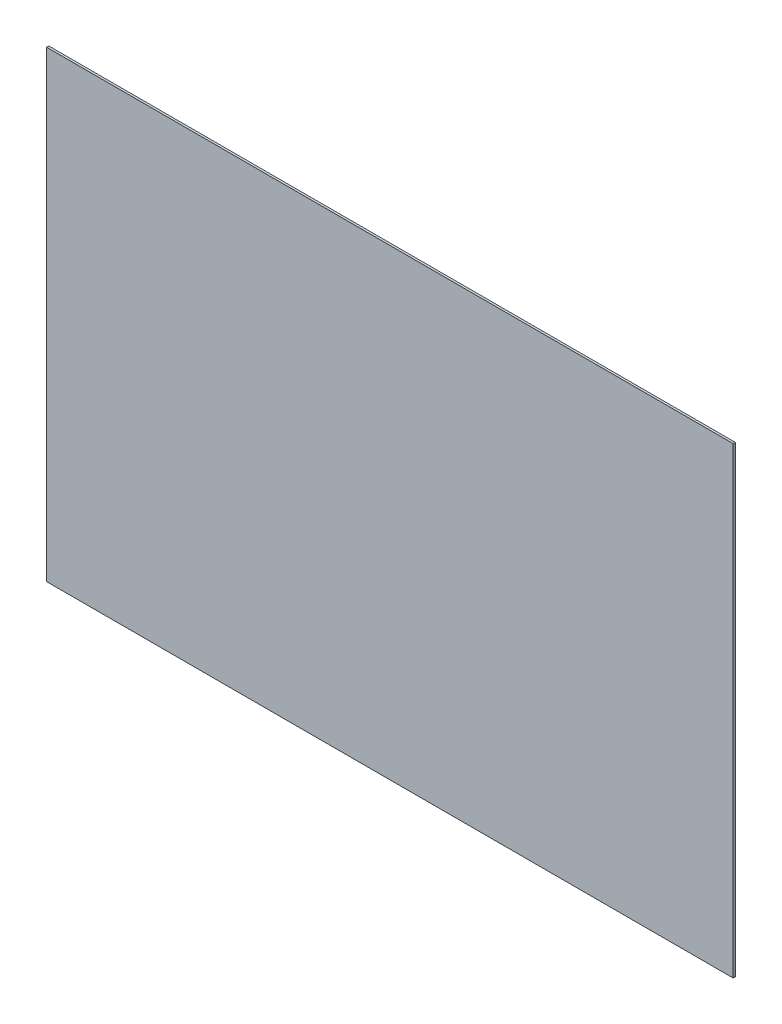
ISO-10303-21;
HEADER;
FILE_DESCRIPTION(('STEP AP214'),'2;1');
FILE_NAME('part.step','',(''),(''),'','','');
FILE_SCHEMA(('AUTOMOTIVE_DESIGN { 1 0 10303 214 1 1 1 1 }'));
ENDSEC;
DATA;
#1=APPLICATION_CONTEXT('core data for automotive mechanical design processes');
#2=APPLICATION_PROTOCOL_DEFINITION('international standard','automotive_design',2000,#1);
#3=PRODUCT_CONTEXT('',#1,'mechanical');
#4=PRODUCT('Part','Part','',(#3));
#5=PRODUCT_RELATED_PRODUCT_CATEGORY('part','',(#4));
#6=PRODUCT_DEFINITION_FORMATION('','',#4);
#7=PRODUCT_DEFINITION_CONTEXT('part definition',#1,'design');
#8=PRODUCT_DEFINITION('design','',#6,#7);
#9=PRODUCT_DEFINITION_SHAPE('','',#8);
#10=(LENGTH_UNIT() NAMED_UNIT(*) SI_UNIT(.MILLI.,.METRE.));
#11=(NAMED_UNIT(*) PLANE_ANGLE_UNIT() SI_UNIT($,.RADIAN.));
#12=(NAMED_UNIT(*) SI_UNIT($,.STERADIAN.) SOLID_ANGLE_UNIT());
#13=UNCERTAINTY_MEASURE_WITH_UNIT(LENGTH_MEASURE(1.E-05),#10,'distance_accuracy_value','');
#14=(GEOMETRIC_REPRESENTATION_CONTEXT(3) GLOBAL_UNCERTAINTY_ASSIGNED_CONTEXT((#13)) GLOBAL_UNIT_ASSIGNED_CONTEXT((#10,
#11,#12)) REPRESENTATION_CONTEXT('',''));
#15=CARTESIAN_POINT('',(0.,0.,0.));
#16=DIRECTION('',(0.,0.,1.));
#17=DIRECTION('',(1.,0.,0.));
#18=AXIS2_PLACEMENT_3D('',#15,#16,#17);
#19=CARTESIAN_POINT('',(0.,0.,3.));
#20=DIRECTION('',(1.,0.,0.));
#21=DIRECTION('',(0.,0.,-1.));
#22=AXIS2_PLACEMENT_3D('',#19,#20,#21);
#23=PLANE('',#22);
#24=DIRECTION('',(0.,-1.,0.));
#25=VECTOR('',#24,1.);
#26=CARTESIAN_POINT('',(0.,0.,0.));
#27=LINE('',#26,#25);
#28=CARTESIAN_POINT('',(0.,638.5,0.));
#29=VERTEX_POINT('',#28);
#30=CARTESIAN_POINT('',(0.,0.,0.));
#31=VERTEX_POINT('',#30);
#32=EDGE_CURVE('E95',#29,#31,#27,.T.);
#33=ORIENTED_EDGE('',*,*,#32,.T.);
#34=DIRECTION('',(0.,0.,-1.));
#35=VECTOR('',#34,1.);
#36=CARTESIAN_POINT('',(0.,0.,3.));
#37=LINE('',#36,#35);
#38=CARTESIAN_POINT('',(0.,0.,3.));
#39=VERTEX_POINT('',#38);
#40=EDGE_CURVE('E11',#39,#31,#37,.T.);
#41=ORIENTED_EDGE('',*,*,#40,.F.);
#42=DIRECTION('',(0.,-1.,0.));
#43=VECTOR('',#42,1.);
#44=CARTESIAN_POINT('',(0.,0.,3.));
#45=LINE('',#44,#43);
#46=CARTESIAN_POINT('',(0.,638.5,3.));
#47=VERTEX_POINT('',#46);
#48=EDGE_CURVE('E83',#47,#39,#45,.T.);
#49=ORIENTED_EDGE('',*,*,#48,.F.);
#50=DIRECTION('',(0.,0.,-1.));
#51=VECTOR('',#50,1.);
#52=CARTESIAN_POINT('',(0.,638.5,3.));
#53=LINE('',#52,#51);
#54=EDGE_CURVE('E91',#47,#29,#53,.T.);
#55=ORIENTED_EDGE('',*,*,#54,.T.);
#56=EDGE_LOOP('',(#33,#41,#49,#55));
#57=FACE_BOUND('',#56,.T.);
#58=ADVANCED_FACE('F32',(#57),#23,.F.);
#59=CARTESIAN_POINT('',(0.,0.,3.));
#60=DIRECTION('',(0.,1.,0.));
#61=DIRECTION('',(0.,0.,1.));
#62=AXIS2_PLACEMENT_3D('',#59,#60,#61);
#63=PLANE('',#62);
#64=DIRECTION('',(1.,0.,0.));
#65=VECTOR('',#64,1.);
#66=CARTESIAN_POINT('',(0.,0.,0.));
#67=LINE('',#66,#65);
#68=CARTESIAN_POINT('',(947.,0.,0.));
#69=VERTEX_POINT('',#68);
#70=EDGE_CURVE('E87',#31,#69,#67,.T.);
#71=ORIENTED_EDGE('',*,*,#70,.T.);
#72=DIRECTION('',(0.,0.,-1.));
#73=VECTOR('',#72,1.);
#74=CARTESIAN_POINT('',(947.,0.,3.));
#75=LINE('',#74,#73);
#76=CARTESIAN_POINT('',(947.,0.,3.));
#77=VERTEX_POINT('',#76);
#78=EDGE_CURVE('E40',#77,#69,#75,.T.);
#79=ORIENTED_EDGE('',*,*,#78,.F.);
#80=DIRECTION('',(1.,0.,0.));
#81=VECTOR('',#80,1.);
#82=CARTESIAN_POINT('',(0.,0.,3.));
#83=LINE('',#82,#81);
#84=EDGE_CURVE('E78',#39,#77,#83,.T.);
#85=ORIENTED_EDGE('',*,*,#84,.F.);
#86=ORIENTED_EDGE('',*,*,#40,.T.);
#87=EDGE_LOOP('',(#71,#79,#85,#86));
#88=FACE_BOUND('',#87,.T.);
#89=ADVANCED_FACE('F86',(#88),#63,.F.);
#90=CARTESIAN_POINT('',(947.,0.,3.));
#91=DIRECTION('',(-1.,0.,0.));
#92=DIRECTION('',(0.,0.,1.));
#93=AXIS2_PLACEMENT_3D('',#90,#91,#92);
#94=PLANE('',#93);
#95=DIRECTION('',(0.,1.,0.));
#96=VECTOR('',#95,1.);
#97=CARTESIAN_POINT('',(947.,0.,0.));
#98=LINE('',#97,#96);
#99=CARTESIAN_POINT('',(947.,638.5,0.));
#100=VERTEX_POINT('',#99);
#101=EDGE_CURVE('E65',#69,#100,#98,.T.);
#102=ORIENTED_EDGE('',*,*,#101,.T.);
#103=DIRECTION('',(0.,0.,-1.));
#104=VECTOR('',#103,1.);
#105=CARTESIAN_POINT('',(947.,638.5,3.));
#106=LINE('',#105,#104);
#107=CARTESIAN_POINT('',(947.,638.5,3.));
#108=VERTEX_POINT('',#107);
#109=EDGE_CURVE('E88',#108,#100,#106,.T.);
#110=ORIENTED_EDGE('',*,*,#109,.F.);
#111=DIRECTION('',(0.,1.,0.));
#112=VECTOR('',#111,1.);
#113=CARTESIAN_POINT('',(947.,0.,3.));
#114=LINE('',#113,#112);
#115=EDGE_CURVE('E81',#77,#108,#114,.T.);
#116=ORIENTED_EDGE('',*,*,#115,.F.);
#117=ORIENTED_EDGE('',*,*,#78,.T.);
#118=EDGE_LOOP('',(#102,#110,#116,#117));
#119=FACE_BOUND('',#118,.T.);
#120=ADVANCED_FACE('F89',(#119),#94,.F.);
#121=CARTESIAN_POINT('',(0.,638.5,3.));
#122=DIRECTION('',(0.,-1.,0.));
#123=DIRECTION('',(0.,0.,-1.));
#124=AXIS2_PLACEMENT_3D('',#121,#122,#123);
#125=PLANE('',#124);
#126=DIRECTION('',(-1.,0.,0.));
#127=VECTOR('',#126,1.);
#128=CARTESIAN_POINT('',(0.,638.5,0.));
#129=LINE('',#128,#127);
#130=EDGE_CURVE('E71',#100,#29,#129,.T.);
#131=ORIENTED_EDGE('',*,*,#130,.T.);
#132=ORIENTED_EDGE('',*,*,#54,.F.);
#133=DIRECTION('',(-1.,0.,0.));
#134=VECTOR('',#133,1.);
#135=CARTESIAN_POINT('',(0.,638.5,3.));
#136=LINE('',#135,#134);
#137=EDGE_CURVE('E48',#108,#47,#136,.T.);
#138=ORIENTED_EDGE('',*,*,#137,.F.);
#139=ORIENTED_EDGE('',*,*,#109,.T.);
#140=EDGE_LOOP('',(#131,#132,#138,#139));
#141=FACE_BOUND('',#140,.T.);
#142=ADVANCED_FACE('F102',(#141),#125,.F.);
#143=CARTESIAN_POINT('',(0.,638.5,3.));
#144=DIRECTION('',(0.,0.,-1.));
#145=DIRECTION('',(-1.,0.,0.));
#146=AXIS2_PLACEMENT_3D('',#143,#144,#145);
#147=PLANE('',#146);
#148=ORIENTED_EDGE('',*,*,#48,.T.);
#149=ORIENTED_EDGE('',*,*,#84,.T.);
#150=ORIENTED_EDGE('',*,*,#115,.T.);
#151=ORIENTED_EDGE('',*,*,#137,.T.);
#152=EDGE_LOOP('',(#148,#149,#150,#151));
#153=FACE_BOUND('',#152,.T.);
#154=ADVANCED_FACE('F79',(#153),#147,.F.);
#155=CARTESIAN_POINT('',(0.,638.5,0.));
#156=DIRECTION('',(0.,0.,-1.));
#157=DIRECTION('',(-1.,0.,0.));
#158=AXIS2_PLACEMENT_3D('',#155,#156,#157);
#159=PLANE('',#158);
#160=ORIENTED_EDGE('',*,*,#32,.F.);
#161=ORIENTED_EDGE('',*,*,#130,.F.);
#162=ORIENTED_EDGE('',*,*,#101,.F.);
#163=ORIENTED_EDGE('',*,*,#70,.F.);
#164=EDGE_LOOP('',(#160,#161,#162,#163));
#165=FACE_BOUND('',#164,.T.);
#166=ADVANCED_FACE('F105',(#165),#159,.T.);
#167=CLOSED_SHELL('',(#58,#89,#120,#142,#154,#166));
#168=MANIFOLD_SOLID_BREP('B2',#167);
#169=ADVANCED_BREP_SHAPE_REPRESENTATION('',(#18,#168),#14);
#170=SHAPE_DEFINITION_REPRESENTATION(#9,#169);
ENDSEC;
END-ISO-10303-21;
